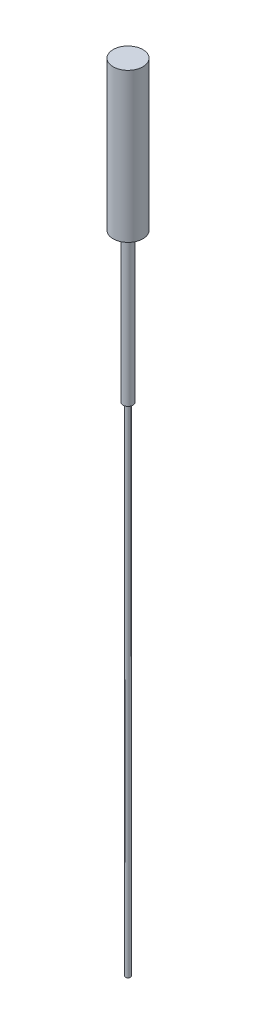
ISO-10303-21;
HEADER;
FILE_DESCRIPTION(('STEP AP214'),'2;1');
FILE_NAME('part.step','',(''),(''),'','','');
FILE_SCHEMA(('AUTOMOTIVE_DESIGN { 1 0 10303 214 1 1 1 1 }'));
ENDSEC;
DATA;
#1=APPLICATION_CONTEXT('core data for automotive mechanical design processes');
#2=APPLICATION_PROTOCOL_DEFINITION('international standard','automotive_design',2000,#1);
#3=PRODUCT_CONTEXT('',#1,'mechanical');
#4=PRODUCT('Part','Part','',(#3));
#5=PRODUCT_RELATED_PRODUCT_CATEGORY('part','',(#4));
#6=PRODUCT_DEFINITION_FORMATION('','',#4);
#7=PRODUCT_DEFINITION_CONTEXT('part definition',#1,'design');
#8=PRODUCT_DEFINITION('design','',#6,#7);
#9=PRODUCT_DEFINITION_SHAPE('','',#8);
#10=(LENGTH_UNIT() NAMED_UNIT(*) SI_UNIT(.MILLI.,.METRE.));
#11=(NAMED_UNIT(*) PLANE_ANGLE_UNIT() SI_UNIT($,.RADIAN.));
#12=(NAMED_UNIT(*) SI_UNIT($,.STERADIAN.) SOLID_ANGLE_UNIT());
#13=UNCERTAINTY_MEASURE_WITH_UNIT(LENGTH_MEASURE(1.E-05),#10,'distance_accuracy_value','');
#14=(GEOMETRIC_REPRESENTATION_CONTEXT(3) GLOBAL_UNCERTAINTY_ASSIGNED_CONTEXT((#13)) GLOBAL_UNIT_ASSIGNED_CONTEXT((#10,
#11,#12)) REPRESENTATION_CONTEXT('',''));
#15=CARTESIAN_POINT('',(0.,0.,0.));
#16=DIRECTION('',(0.,0.,1.));
#17=DIRECTION('',(1.,0.,0.));
#18=AXIS2_PLACEMENT_3D('',#15,#16,#17);
#19=CARTESIAN_POINT('',(0.,0.,0.));
#20=DIRECTION('',(0.,-1.,0.));
#21=DIRECTION('',(0.,0.,-1.));
#22=AXIS2_PLACEMENT_3D('',#19,#20,#21);
#23=PLANE('',#22);
#24=CARTESIAN_POINT('',(0.,0.,0.));
#25=DIRECTION('',(0.,-1.,0.));
#26=DIRECTION('',(0.,0.,-1.));
#27=AXIS2_PLACEMENT_3D('',#24,#25,#26);
#28=CIRCLE('',#27,0.25);
#29=CARTESIAN_POINT('',(0.,0.,-0.25));
#30=VERTEX_POINT('',#29);
#31=EDGE_CURVE('E34',#30,#30,#28,.T.);
#32=ORIENTED_EDGE('',*,*,#31,.F.);
#33=EDGE_LOOP('',(#32));
#34=FACE_BOUND('',#33,.T.);
#35=CARTESIAN_POINT('',(0.,0.,0.));
#36=DIRECTION('',(0.,-1.,0.));
#37=DIRECTION('',(0.,0.,-1.));
#38=AXIS2_PLACEMENT_3D('',#35,#36,#37);
#39=CIRCLE('',#38,0.5);
#40=CARTESIAN_POINT('',(0.,0.,-0.5));
#41=VERTEX_POINT('',#40);
#42=EDGE_CURVE('E10',#41,#41,#39,.T.);
#43=ORIENTED_EDGE('',*,*,#42,.T.);
#44=EDGE_LOOP('',(#43));
#45=FACE_BOUND('',#44,.T.);
#46=ADVANCED_FACE('F14',(#34,#45),#23,.T.);
#47=CARTESIAN_POINT('',(0.,0.,0.));
#48=DIRECTION('',(0.,-1.,0.));
#49=DIRECTION('',(0.,0.,-1.));
#50=AXIS2_PLACEMENT_3D('',#47,#48,#49);
#51=CYLINDRICAL_SURFACE('',#50,0.5);
#52=CARTESIAN_POINT('',(0.,15.,0.));
#53=DIRECTION('',(0.,-1.,0.));
#54=DIRECTION('',(0.,0.,-1.));
#55=AXIS2_PLACEMENT_3D('',#52,#53,#54);
#56=CIRCLE('',#55,0.5);
#57=CARTESIAN_POINT('',(0.,15.,-0.5));
#58=VERTEX_POINT('',#57);
#59=EDGE_CURVE('E20',#58,#58,#56,.T.);
#60=ORIENTED_EDGE('',*,*,#59,.T.);
#61=EDGE_LOOP('',(#60));
#62=FACE_BOUND('',#61,.T.);
#63=ORIENTED_EDGE('',*,*,#42,.F.);
#64=EDGE_LOOP('',(#63));
#65=FACE_BOUND('',#64,.T.);
#66=ADVANCED_FACE('F50',(#62,#65),#51,.T.);
#67=CARTESIAN_POINT('',(0.5,15.,0.));
#68=DIRECTION('',(0.,-1.,0.));
#69=DIRECTION('',(0.,0.,-1.));
#70=AXIS2_PLACEMENT_3D('',#67,#68,#69);
#71=PLANE('',#70);
#72=CARTESIAN_POINT('',(0.,15.,0.));
#73=DIRECTION('',(0.,-1.,0.));
#74=DIRECTION('',(0.,0.,-1.));
#75=AXIS2_PLACEMENT_3D('',#72,#73,#74);
#76=CIRCLE('',#75,1.5);
#77=CARTESIAN_POINT('',(0.,15.,-1.5));
#78=VERTEX_POINT('',#77);
#79=EDGE_CURVE('E24',#78,#78,#76,.T.);
#80=ORIENTED_EDGE('',*,*,#79,.T.);
#81=EDGE_LOOP('',(#80));
#82=FACE_BOUND('',#81,.T.);
#83=ORIENTED_EDGE('',*,*,#59,.F.);
#84=EDGE_LOOP('',(#83));
#85=FACE_BOUND('',#84,.T.);
#86=ADVANCED_FACE('F56',(#82,#85),#71,.T.);
#87=CARTESIAN_POINT('',(0.,0.,0.));
#88=DIRECTION('',(0.,-1.,0.));
#89=DIRECTION('',(0.,0.,-1.));
#90=AXIS2_PLACEMENT_3D('',#87,#88,#89);
#91=CYLINDRICAL_SURFACE('',#90,1.5);
#92=CARTESIAN_POINT('',(0.,30.,0.));
#93=DIRECTION('',(0.,-1.,0.));
#94=DIRECTION('',(0.,0.,-1.));
#95=AXIS2_PLACEMENT_3D('',#92,#93,#94);
#96=CIRCLE('',#95,1.5);
#97=CARTESIAN_POINT('',(0.,30.,-1.5));
#98=VERTEX_POINT('',#97);
#99=EDGE_CURVE('E28',#98,#98,#96,.T.);
#100=ORIENTED_EDGE('',*,*,#99,.T.);
#101=EDGE_LOOP('',(#100));
#102=FACE_BOUND('',#101,.T.);
#103=ORIENTED_EDGE('',*,*,#79,.F.);
#104=EDGE_LOOP('',(#103));
#105=FACE_BOUND('',#104,.T.);
#106=ADVANCED_FACE('F61',(#102,#105),#91,.T.);
#107=CARTESIAN_POINT('',(1.5,30.,0.));
#108=DIRECTION('',(0.,1.,0.));
#109=DIRECTION('',(0.,0.,1.));
#110=AXIS2_PLACEMENT_3D('',#107,#108,#109);
#111=PLANE('',#110);
#112=ORIENTED_EDGE('',*,*,#99,.F.);
#113=EDGE_LOOP('',(#112));
#114=FACE_BOUND('',#113,.T.);
#115=ADVANCED_FACE('F45',(#114),#111,.T.);
#116=CARTESIAN_POINT('',(0.,-50.,0.));
#117=DIRECTION('',(0.,1.,0.));
#118=DIRECTION('',(0.,0.,1.));
#119=AXIS2_PLACEMENT_3D('',#116,#117,#118);
#120=CYLINDRICAL_SURFACE('',#119,0.25);
#121=CARTESIAN_POINT('',(0.,-50.,0.));
#122=DIRECTION('',(0.,-1.,0.));
#123=DIRECTION('',(0.,0.,-1.));
#124=AXIS2_PLACEMENT_3D('',#121,#122,#123);
#125=CIRCLE('',#124,0.25);
#126=CARTESIAN_POINT('',(0.,-50.,-0.25));
#127=VERTEX_POINT('',#126);
#128=EDGE_CURVE('E33',#127,#127,#125,.T.);
#129=ORIENTED_EDGE('',*,*,#128,.F.);
#130=EDGE_LOOP('',(#129));
#131=FACE_BOUND('',#130,.T.);
#132=ORIENTED_EDGE('',*,*,#31,.T.);
#133=EDGE_LOOP('',(#132));
#134=FACE_BOUND('',#133,.T.);
#135=ADVANCED_FACE('F42',(#131,#134),#120,.T.);
#136=CARTESIAN_POINT('',(0.,-50.,0.));
#137=DIRECTION('',(0.,-1.,0.));
#138=DIRECTION('',(0.,0.,-1.));
#139=AXIS2_PLACEMENT_3D('',#136,#137,#138);
#140=PLANE('',#139);
#141=ORIENTED_EDGE('',*,*,#128,.T.);
#142=EDGE_LOOP('',(#141));
#143=FACE_BOUND('',#142,.T.);
#144=ADVANCED_FACE('F40',(#143),#140,.T.);
#145=CLOSED_SHELL('',(#46,#66,#86,#106,#115,#135,#144));
#146=MANIFOLD_SOLID_BREP('B1',#145);
#147=ADVANCED_BREP_SHAPE_REPRESENTATION('',(#18,#146),#14);
#148=SHAPE_DEFINITION_REPRESENTATION(#9,#147);
ENDSEC;
END-ISO-10303-21;
